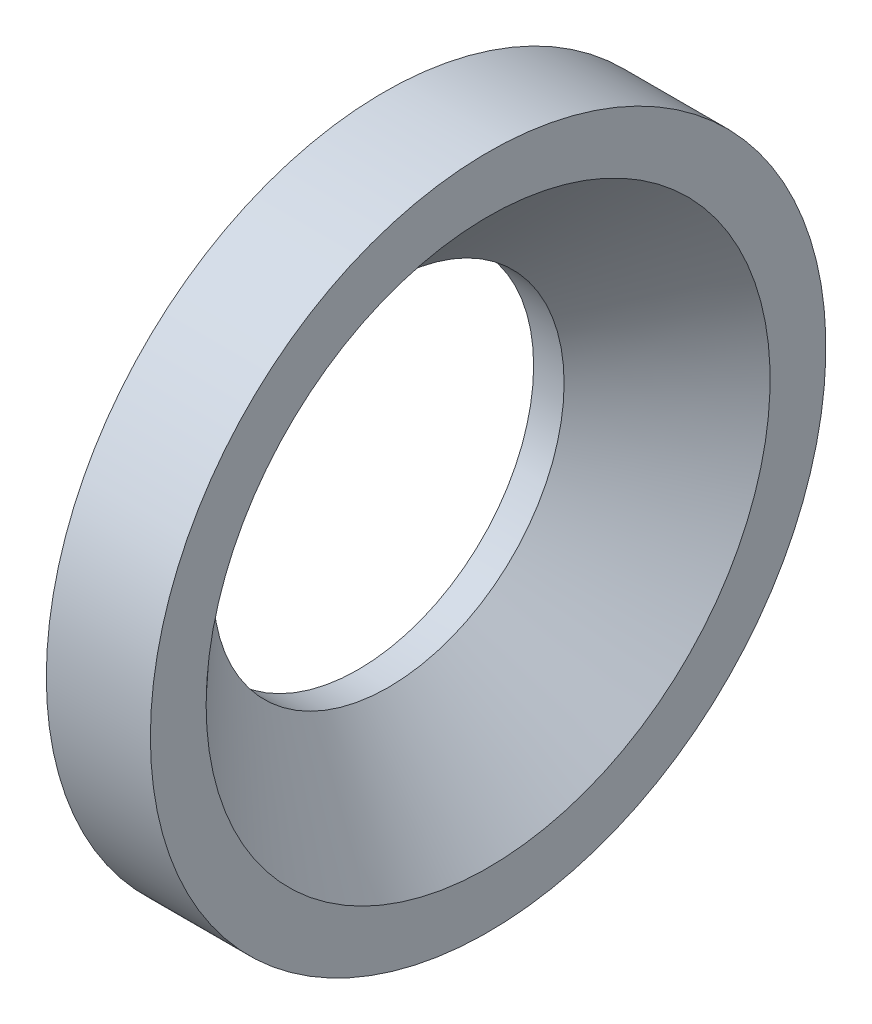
ISO-10303-21;
HEADER;
FILE_DESCRIPTION(('STEP AP214'),'2;1');
FILE_NAME('part.step','',(''),(''),'','','');
FILE_SCHEMA(('AUTOMOTIVE_DESIGN { 1 0 10303 214 1 1 1 1 }'));
ENDSEC;
DATA;
#1=APPLICATION_CONTEXT('core data for automotive mechanical design processes');
#2=APPLICATION_PROTOCOL_DEFINITION('international standard','automotive_design',2000,#1);
#3=PRODUCT_CONTEXT('',#1,'mechanical');
#4=PRODUCT('Part','Part','',(#3));
#5=PRODUCT_RELATED_PRODUCT_CATEGORY('part','',(#4));
#6=PRODUCT_DEFINITION_FORMATION('','',#4);
#7=PRODUCT_DEFINITION_CONTEXT('part definition',#1,'design');
#8=PRODUCT_DEFINITION('design','',#6,#7);
#9=PRODUCT_DEFINITION_SHAPE('','',#8);
#10=(LENGTH_UNIT() NAMED_UNIT(*) SI_UNIT(.MILLI.,.METRE.));
#11=(NAMED_UNIT(*) PLANE_ANGLE_UNIT() SI_UNIT($,.RADIAN.));
#12=(NAMED_UNIT(*) SI_UNIT($,.STERADIAN.) SOLID_ANGLE_UNIT());
#13=UNCERTAINTY_MEASURE_WITH_UNIT(LENGTH_MEASURE(1.E-05),#10,'distance_accuracy_value','');
#14=(GEOMETRIC_REPRESENTATION_CONTEXT(3) GLOBAL_UNCERTAINTY_ASSIGNED_CONTEXT((#13)) GLOBAL_UNIT_ASSIGNED_CONTEXT((#10,
#11,#12)) REPRESENTATION_CONTEXT('',''));
#15=CARTESIAN_POINT('',(0.,0.,0.));
#16=DIRECTION('',(0.,0.,1.));
#17=DIRECTION('',(1.,0.,0.));
#18=AXIS2_PLACEMENT_3D('',#15,#16,#17);
#19=CARTESIAN_POINT('',(0.,15.,0.));
#20=DIRECTION('',(1.,0.,0.));
#21=DIRECTION('',(0.,0.,-1.));
#22=AXIS2_PLACEMENT_3D('',#19,#20,#21);
#23=PLANE('',#22);
#24=CARTESIAN_POINT('',(0.,0.,0.));
#25=DIRECTION('',(-1.,0.,0.));
#26=DIRECTION('',(0.,0.,1.));
#27=AXIS2_PLACEMENT_3D('',#24,#25,#26);
#28=CIRCLE('',#27,15.);
#29=CARTESIAN_POINT('',(0.,0.,15.));
#30=VERTEX_POINT('',#29);
#31=EDGE_CURVE('E10',#30,#30,#28,.T.);
#32=ORIENTED_EDGE('',*,*,#31,.F.);
#33=EDGE_LOOP('',(#32));
#34=FACE_BOUND('',#33,.T.);
#35=CARTESIAN_POINT('',(0.,0.,0.));
#36=DIRECTION('',(-1.,0.,0.));
#37=DIRECTION('',(0.,0.,1.));
#38=AXIS2_PLACEMENT_3D('',#35,#36,#37);
#39=CIRCLE('',#38,18.81);
#40=CARTESIAN_POINT('',(0.,0.,18.81));
#41=VERTEX_POINT('',#40);
#42=EDGE_CURVE('E56',#41,#41,#39,.T.);
#43=ORIENTED_EDGE('',*,*,#42,.T.);
#44=EDGE_LOOP('',(#43));
#45=FACE_BOUND('',#44,.T.);
#46=ADVANCED_FACE('F34',(#34,#45),#23,.F.);
#47=CARTESIAN_POINT('',(-37.9924867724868,0.,0.));
#48=DIRECTION('',(-1.,0.,0.));
#49=DIRECTION('',(0.,0.,1.));
#50=AXIS2_PLACEMENT_3D('',#47,#48,#49);
#51=CYLINDRICAL_SURFACE('',#50,15.);
#52=CARTESIAN_POINT('',(2.6035,0.,0.));
#53=DIRECTION('',(-1.,0.,0.));
#54=DIRECTION('',(0.,0.,1.));
#55=AXIS2_PLACEMENT_3D('',#52,#53,#54);
#56=CIRCLE('',#55,15.);
#57=CARTESIAN_POINT('',(2.6035,0.,15.));
#58=VERTEX_POINT('',#57);
#59=EDGE_CURVE('E40',#58,#58,#56,.T.);
#60=ORIENTED_EDGE('',*,*,#59,.F.);
#61=EDGE_LOOP('',(#60));
#62=FACE_BOUND('',#61,.T.);
#63=ORIENTED_EDGE('',*,*,#31,.T.);
#64=EDGE_LOOP('',(#63));
#65=FACE_BOUND('',#64,.T.);
#66=ADVANCED_FACE('F81',(#62,#65),#51,.F.);
#67=CARTESIAN_POINT('',(2.6035,0.,0.));
#68=DIRECTION('',(1.,0.,0.));
#69=DIRECTION('',(0.,0.,-1.));
#70=AXIS2_PLACEMENT_3D('',#67,#68,#69);
#71=CONICAL_SURFACE('',#70,15.,0.818503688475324);
#72=CARTESIAN_POINT('',(11.1125,0.,0.));
#73=DIRECTION('',(-1.,0.,0.));
#74=DIRECTION('',(0.,0.,1.));
#75=AXIS2_PLACEMENT_3D('',#72,#73,#74);
#76=CIRCLE('',#75,24.0919);
#77=CARTESIAN_POINT('',(11.1125,0.,24.0919));
#78=VERTEX_POINT('',#77);
#79=EDGE_CURVE('E44',#78,#78,#76,.T.);
#80=ORIENTED_EDGE('',*,*,#79,.F.);
#81=EDGE_LOOP('',(#80));
#82=FACE_BOUND('',#81,.T.);
#83=ORIENTED_EDGE('',*,*,#59,.T.);
#84=EDGE_LOOP('',(#83));
#85=FACE_BOUND('',#84,.T.);
#86=ADVANCED_FACE('F76',(#82,#85),#71,.F.);
#87=CARTESIAN_POINT('',(11.1125,24.0919,0.));
#88=DIRECTION('',(-1.,0.,0.));
#89=DIRECTION('',(0.,0.,1.));
#90=AXIS2_PLACEMENT_3D('',#87,#88,#89);
#91=PLANE('',#90);
#92=CARTESIAN_POINT('',(11.1125,0.,0.));
#93=DIRECTION('',(-1.,0.,0.));
#94=DIRECTION('',(0.,0.,1.));
#95=AXIS2_PLACEMENT_3D('',#92,#93,#94);
#96=CIRCLE('',#95,28.8544);
#97=CARTESIAN_POINT('',(11.1125,0.,28.8544));
#98=VERTEX_POINT('',#97);
#99=EDGE_CURVE('E48',#98,#98,#96,.T.);
#100=ORIENTED_EDGE('',*,*,#99,.F.);
#101=EDGE_LOOP('',(#100));
#102=FACE_BOUND('',#101,.T.);
#103=ORIENTED_EDGE('',*,*,#79,.T.);
#104=EDGE_LOOP('',(#103));
#105=FACE_BOUND('',#104,.T.);
#106=ADVANCED_FACE('F70',(#102,#105),#91,.F.);
#107=CARTESIAN_POINT('',(-37.9924867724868,0.,0.));
#108=DIRECTION('',(-1.,0.,0.));
#109=DIRECTION('',(0.,0.,1.));
#110=AXIS2_PLACEMENT_3D('',#107,#108,#109);
#111=CYLINDRICAL_SURFACE('',#110,28.8544);
#112=CARTESIAN_POINT('',(2.2225,0.,0.));
#113=DIRECTION('',(-1.,0.,0.));
#114=DIRECTION('',(0.,0.,1.));
#115=AXIS2_PLACEMENT_3D('',#112,#113,#114);
#116=CIRCLE('',#115,28.8544);
#117=CARTESIAN_POINT('',(2.2225,0.,28.8544));
#118=VERTEX_POINT('',#117);
#119=EDGE_CURVE('E53',#118,#118,#116,.T.);
#120=ORIENTED_EDGE('',*,*,#119,.F.);
#121=EDGE_LOOP('',(#120));
#122=FACE_BOUND('',#121,.T.);
#123=ORIENTED_EDGE('',*,*,#99,.T.);
#124=EDGE_LOOP('',(#123));
#125=FACE_BOUND('',#124,.T.);
#126=ADVANCED_FACE('F64',(#122,#125),#111,.T.);
#127=CARTESIAN_POINT('',(2.2225,0.,0.));
#128=DIRECTION('',(1.,0.,0.));
#129=DIRECTION('',(0.,0.,-1.));
#130=AXIS2_PLACEMENT_3D('',#127,#128,#129);
#131=CONICAL_SURFACE('',#130,28.8544,1.35303729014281);
#132=ORIENTED_EDGE('',*,*,#42,.F.);
#133=EDGE_LOOP('',(#132));
#134=FACE_BOUND('',#133,.T.);
#135=ORIENTED_EDGE('',*,*,#119,.T.);
#136=EDGE_LOOP('',(#135));
#137=FACE_BOUND('',#136,.T.);
#138=ADVANCED_FACE('F61',(#134,#137),#131,.T.);
#139=CLOSED_SHELL('',(#46,#66,#86,#106,#126,#138));
#140=MANIFOLD_SOLID_BREP('B2',#139);
#141=ADVANCED_BREP_SHAPE_REPRESENTATION('',(#18,#140),#14);
#142=SHAPE_DEFINITION_REPRESENTATION(#9,#141);
ENDSEC;
END-ISO-10303-21;
